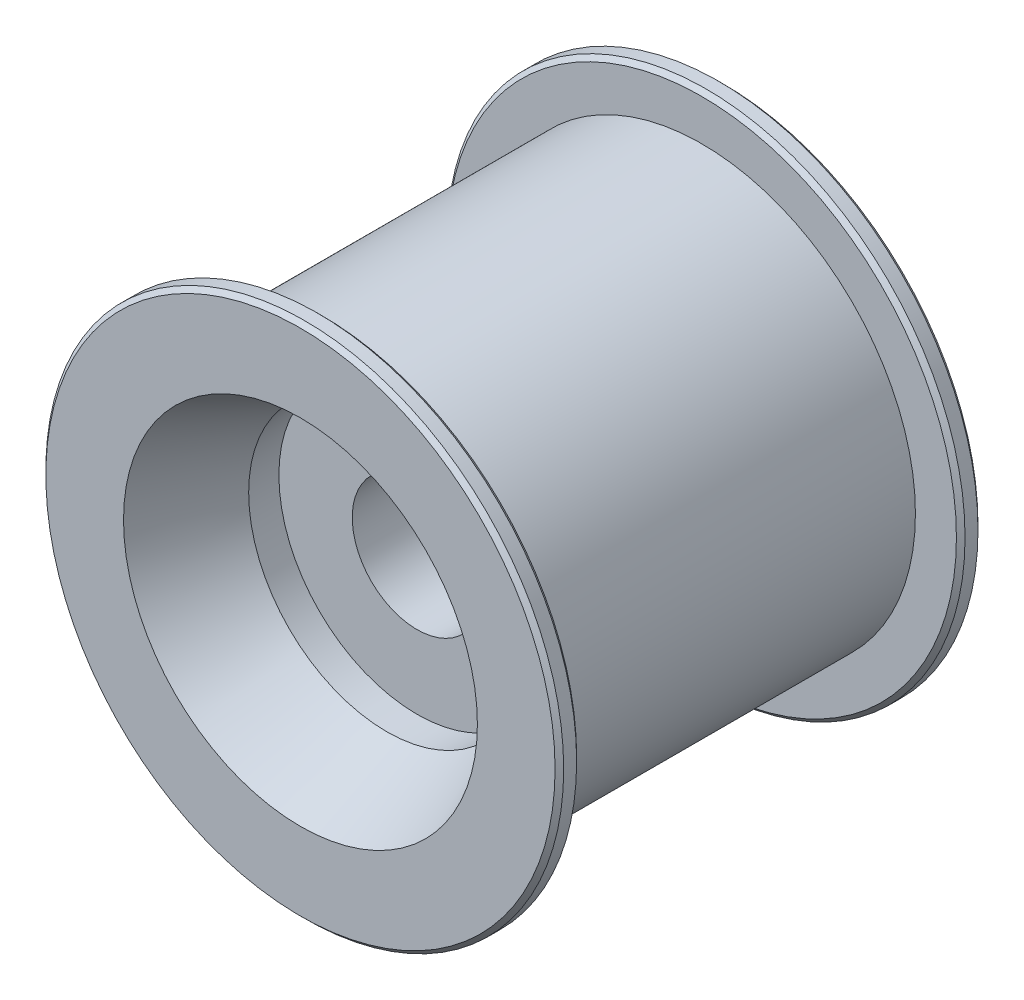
ISO-10303-21;
HEADER;
FILE_DESCRIPTION(('STEP AP214'),'2;1');
FILE_NAME('part.step','',(''),(''),'','','');
FILE_SCHEMA(('AUTOMOTIVE_DESIGN { 1 0 10303 214 1 1 1 1 }'));
ENDSEC;
DATA;
#1=APPLICATION_CONTEXT('core data for automotive mechanical design processes');
#2=APPLICATION_PROTOCOL_DEFINITION('international standard','automotive_design',2000,#1);
#3=PRODUCT_CONTEXT('',#1,'mechanical');
#4=PRODUCT('Part','Part','',(#3));
#5=PRODUCT_RELATED_PRODUCT_CATEGORY('part','',(#4));
#6=PRODUCT_DEFINITION_FORMATION('','',#4);
#7=PRODUCT_DEFINITION_CONTEXT('part definition',#1,'design');
#8=PRODUCT_DEFINITION('design','',#6,#7);
#9=PRODUCT_DEFINITION_SHAPE('','',#8);
#10=(LENGTH_UNIT() NAMED_UNIT(*) SI_UNIT(.MILLI.,.METRE.));
#11=(NAMED_UNIT(*) PLANE_ANGLE_UNIT() SI_UNIT($,.RADIAN.));
#12=(NAMED_UNIT(*) SI_UNIT($,.STERADIAN.) SOLID_ANGLE_UNIT());
#13=UNCERTAINTY_MEASURE_WITH_UNIT(LENGTH_MEASURE(1.E-05),#10,'distance_accuracy_value','');
#14=(GEOMETRIC_REPRESENTATION_CONTEXT(3) GLOBAL_UNCERTAINTY_ASSIGNED_CONTEXT((#13)) GLOBAL_UNIT_ASSIGNED_CONTEXT((#10,
#11,#12)) REPRESENTATION_CONTEXT('',''));
#15=CARTESIAN_POINT('',(0.,0.,0.));
#16=DIRECTION('',(0.,0.,1.));
#17=DIRECTION('',(1.,0.,0.));
#18=AXIS2_PLACEMENT_3D('',#15,#16,#17);
#19=CARTESIAN_POINT('',(0.,-7.5,-11.));
#20=DIRECTION('',(0.,0.,-1.));
#21=DIRECTION('',(1.,0.,0.));
#22=AXIS2_PLACEMENT_3D('',#19,#20,#21);
#23=PLANE('',#22);
#24=CARTESIAN_POINT('',(0.,0.,-11.));
#25=DIRECTION('',(0.,0.,-1.));
#26=DIRECTION('',(1.,0.,0.));
#27=AXIS2_PLACEMENT_3D('',#24,#25,#26);
#28=CIRCLE('',#27,16.);
#29=CARTESIAN_POINT('',(16.,0.,-11.));
#30=VERTEX_POINT('',#29);
#31=EDGE_CURVE('E71',#30,#30,#28,.T.);
#32=ORIENTED_EDGE('',*,*,#31,.T.);
#33=EDGE_LOOP('',(#32));
#34=FACE_BOUND('',#33,.T.);
#35=CARTESIAN_POINT('',(0.,0.,-11.));
#36=DIRECTION('',(0.,0.,-1.));
#37=DIRECTION('',(1.,0.,0.));
#38=AXIS2_PLACEMENT_3D('',#35,#36,#37);
#39=CIRCLE('',#38,7.5);
#40=CARTESIAN_POINT('',(7.5,0.,-11.));
#41=VERTEX_POINT('',#40);
#42=EDGE_CURVE('E44',#41,#41,#39,.T.);
#43=ORIENTED_EDGE('',*,*,#42,.F.);
#44=EDGE_LOOP('',(#43));
#45=FACE_BOUND('',#44,.T.);
#46=ADVANCED_FACE('F12',(#34,#45),#23,.T.);
#47=CARTESIAN_POINT('',(0.,0.,-20.));
#48=DIRECTION('',(0.,0.,-1.));
#49=DIRECTION('',(1.,0.,0.));
#50=AXIS2_PLACEMENT_3D('',#47,#48,#49);
#51=CYLINDRICAL_SURFACE('',#50,7.5);
#52=ORIENTED_EDGE('',*,*,#42,.T.);
#53=EDGE_LOOP('',(#52));
#54=FACE_BOUND('',#53,.T.);
#55=CARTESIAN_POINT('',(0.,0.,11.));
#56=DIRECTION('',(0.,0.,-1.));
#57=DIRECTION('',(1.,0.,0.));
#58=AXIS2_PLACEMENT_3D('',#55,#56,#57);
#59=CIRCLE('',#58,7.5);
#60=CARTESIAN_POINT('',(7.5,0.,11.));
#61=VERTEX_POINT('',#60);
#62=EDGE_CURVE('E47',#61,#61,#59,.T.);
#63=ORIENTED_EDGE('',*,*,#62,.F.);
#64=EDGE_LOOP('',(#63));
#65=FACE_BOUND('',#64,.T.);
#66=ADVANCED_FACE('F96',(#54,#65),#51,.F.);
#67=CARTESIAN_POINT('',(0.,-7.5,11.));
#68=DIRECTION('',(0.,0.,-1.));
#69=DIRECTION('',(1.,0.,0.));
#70=AXIS2_PLACEMENT_3D('',#67,#68,#69);
#71=PLANE('',#70);
#72=CARTESIAN_POINT('',(0.,0.,11.));
#73=DIRECTION('',(0.,0.,-1.));
#74=DIRECTION('',(1.,0.,0.));
#75=AXIS2_PLACEMENT_3D('',#72,#73,#74);
#76=CIRCLE('',#75,16.);
#77=CARTESIAN_POINT('',(16.,0.,11.));
#78=VERTEX_POINT('',#77);
#79=EDGE_CURVE('E50',#78,#78,#76,.T.);
#80=ORIENTED_EDGE('',*,*,#79,.F.);
#81=EDGE_LOOP('',(#80));
#82=FACE_BOUND('',#81,.T.);
#83=ORIENTED_EDGE('',*,*,#62,.T.);
#84=EDGE_LOOP('',(#83));
#85=FACE_BOUND('',#84,.T.);
#86=ADVANCED_FACE('F102',(#82,#85),#71,.F.);
#87=CARTESIAN_POINT('',(0.,0.,-20.));
#88=DIRECTION('',(0.,0.,-1.));
#89=DIRECTION('',(1.,0.,0.));
#90=AXIS2_PLACEMENT_3D('',#87,#88,#89);
#91=CYLINDRICAL_SURFACE('',#90,16.);
#92=CARTESIAN_POINT('',(0.,0.,14.5));
#93=DIRECTION('',(0.,0.,-1.));
#94=DIRECTION('',(1.,0.,0.));
#95=AXIS2_PLACEMENT_3D('',#92,#93,#94);
#96=CIRCLE('',#95,16.);
#97=CARTESIAN_POINT('',(16.,0.,14.5));
#98=VERTEX_POINT('',#97);
#99=EDGE_CURVE('E53',#98,#98,#96,.T.);
#100=ORIENTED_EDGE('',*,*,#99,.F.);
#101=EDGE_LOOP('',(#100));
#102=FACE_BOUND('',#101,.T.);
#103=ORIENTED_EDGE('',*,*,#79,.T.);
#104=EDGE_LOOP('',(#103));
#105=FACE_BOUND('',#104,.T.);
#106=ADVANCED_FACE('F141',(#102,#105),#91,.F.);
#107=CARTESIAN_POINT('',(0.,0.,14.5));
#108=DIRECTION('',(0.,0.,1.));
#109=DIRECTION('',(-1.,0.,0.));
#110=AXIS2_PLACEMENT_3D('',#107,#108,#109);
#111=CONICAL_SURFACE('',#110,16.,0.42285392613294);
#112=CARTESIAN_POINT('',(0.,0.,24.5));
#113=DIRECTION('',(0.,0.,-1.));
#114=DIRECTION('',(1.,0.,0.));
#115=AXIS2_PLACEMENT_3D('',#112,#113,#114);
#116=CIRCLE('',#115,20.5);
#117=CARTESIAN_POINT('',(20.5,0.,24.5));
#118=VERTEX_POINT('',#117);
#119=EDGE_CURVE('E56',#118,#118,#116,.T.);
#120=ORIENTED_EDGE('',*,*,#119,.F.);
#121=EDGE_LOOP('',(#120));
#122=FACE_BOUND('',#121,.T.);
#123=ORIENTED_EDGE('',*,*,#99,.T.);
#124=EDGE_LOOP('',(#123));
#125=FACE_BOUND('',#124,.T.);
#126=ADVANCED_FACE('F135',(#122,#125),#111,.F.);
#127=CARTESIAN_POINT('',(0.,-30.,24.5));
#128=DIRECTION('',(0.,0.,1.));
#129=DIRECTION('',(-1.,0.,0.));
#130=AXIS2_PLACEMENT_3D('',#127,#128,#129);
#131=PLANE('',#130);
#132=CARTESIAN_POINT('',(0.,0.,24.5));
#133=DIRECTION('',(0.,0.,1.));
#134=DIRECTION('',(1.,0.,0.));
#135=AXIS2_PLACEMENT_3D('',#132,#133,#134);
#136=CIRCLE('',#135,29.5);
#137=CARTESIAN_POINT('',(29.5,0.,24.5));
#138=VERTEX_POINT('',#137);
#139=EDGE_CURVE('E19',#138,#138,#136,.T.);
#140=ORIENTED_EDGE('',*,*,#139,.T.);
#141=EDGE_LOOP('',(#140));
#142=FACE_BOUND('',#141,.T.);
#143=ORIENTED_EDGE('',*,*,#119,.T.);
#144=EDGE_LOOP('',(#143));
#145=FACE_BOUND('',#144,.T.);
#146=ADVANCED_FACE('F124',(#142,#145),#131,.T.);
#147=CARTESIAN_POINT('',(0.,0.,-20.));
#148=DIRECTION('',(0.,0.,-1.));
#149=DIRECTION('',(1.,0.,0.));
#150=AXIS2_PLACEMENT_3D('',#147,#148,#149);
#151=CYLINDRICAL_SURFACE('',#150,30.);
#152=CARTESIAN_POINT('',(0.,0.,24.));
#153=DIRECTION('',(0.,0.,1.));
#154=DIRECTION('',(1.,0.,0.));
#155=AXIS2_PLACEMENT_3D('',#152,#153,#154);
#156=CIRCLE('',#155,30.);
#157=CARTESIAN_POINT('',(30.,0.,24.));
#158=VERTEX_POINT('',#157);
#159=EDGE_CURVE('E23',#158,#158,#156,.F.);
#160=ORIENTED_EDGE('',*,*,#159,.T.);
#161=EDGE_LOOP('',(#160));
#162=FACE_BOUND('',#161,.T.);
#163=CARTESIAN_POINT('',(0.,0.,22.5));
#164=DIRECTION('',(0.,0.,1.));
#165=DIRECTION('',(1.,0.,0.));
#166=AXIS2_PLACEMENT_3D('',#163,#164,#165);
#167=CIRCLE('',#166,30.);
#168=CARTESIAN_POINT('',(30.,0.,22.5));
#169=VERTEX_POINT('',#168);
#170=EDGE_CURVE('E27',#169,#169,#167,.T.);
#171=ORIENTED_EDGE('',*,*,#170,.T.);
#172=EDGE_LOOP('',(#171));
#173=FACE_BOUND('',#172,.T.);
#174=ADVANCED_FACE('F120',(#162,#173),#151,.T.);
#175=CARTESIAN_POINT('',(0.,-30.,22.));
#176=DIRECTION('',(0.,0.,1.));
#177=DIRECTION('',(-1.,0.,0.));
#178=AXIS2_PLACEMENT_3D('',#175,#176,#177);
#179=PLANE('',#178);
#180=CARTESIAN_POINT('',(0.,0.,22.));
#181=DIRECTION('',(0.,0.,1.));
#182=DIRECTION('',(1.,0.,0.));
#183=AXIS2_PLACEMENT_3D('',#180,#181,#182);
#184=CIRCLE('',#183,29.5);
#185=CARTESIAN_POINT('',(29.5,0.,22.));
#186=VERTEX_POINT('',#185);
#187=EDGE_CURVE('E8',#186,#186,#184,.F.);
#188=ORIENTED_EDGE('',*,*,#187,.T.);
#189=EDGE_LOOP('',(#188));
#190=FACE_BOUND('',#189,.T.);
#191=CARTESIAN_POINT('',(0.,0.,22.));
#192=DIRECTION('',(0.,0.,-1.));
#193=DIRECTION('',(1.,0.,0.));
#194=AXIS2_PLACEMENT_3D('',#191,#192,#193);
#195=CIRCLE('',#194,24.75);
#196=CARTESIAN_POINT('',(24.75,0.,22.));
#197=VERTEX_POINT('',#196);
#198=EDGE_CURVE('E59',#197,#197,#195,.T.);
#199=ORIENTED_EDGE('',*,*,#198,.F.);
#200=EDGE_LOOP('',(#199));
#201=FACE_BOUND('',#200,.T.);
#202=ADVANCED_FACE('F123',(#190,#201),#179,.F.);
#203=CARTESIAN_POINT('',(0.,0.,-20.));
#204=DIRECTION('',(0.,0.,-1.));
#205=DIRECTION('',(1.,0.,0.));
#206=AXIS2_PLACEMENT_3D('',#203,#204,#205);
#207=CYLINDRICAL_SURFACE('',#206,24.75);
#208=ORIENTED_EDGE('',*,*,#198,.T.);
#209=EDGE_LOOP('',(#208));
#210=FACE_BOUND('',#209,.T.);
#211=CARTESIAN_POINT('',(0.,0.,-22.));
#212=DIRECTION('',(0.,0.,-1.));
#213=DIRECTION('',(1.,0.,0.));
#214=AXIS2_PLACEMENT_3D('',#211,#212,#213);
#215=CIRCLE('',#214,24.75);
#216=CARTESIAN_POINT('',(24.75,0.,-22.));
#217=VERTEX_POINT('',#216);
#218=EDGE_CURVE('E62',#217,#217,#215,.T.);
#219=ORIENTED_EDGE('',*,*,#218,.F.);
#220=EDGE_LOOP('',(#219));
#221=FACE_BOUND('',#220,.T.);
#222=ADVANCED_FACE('F133',(#210,#221),#207,.T.);
#223=CARTESIAN_POINT('',(0.,-30.,-22.));
#224=DIRECTION('',(0.,0.,1.));
#225=DIRECTION('',(-1.,0.,0.));
#226=AXIS2_PLACEMENT_3D('',#223,#224,#225);
#227=PLANE('',#226);
#228=CARTESIAN_POINT('',(0.,0.,-22.));
#229=DIRECTION('',(0.,0.,1.));
#230=DIRECTION('',(1.,0.,0.));
#231=AXIS2_PLACEMENT_3D('',#228,#229,#230);
#232=CIRCLE('',#231,29.5);
#233=CARTESIAN_POINT('',(29.5,0.,-22.));
#234=VERTEX_POINT('',#233);
#235=EDGE_CURVE('E32',#234,#234,#232,.T.);
#236=ORIENTED_EDGE('',*,*,#235,.T.);
#237=EDGE_LOOP('',(#236));
#238=FACE_BOUND('',#237,.T.);
#239=ORIENTED_EDGE('',*,*,#218,.T.);
#240=EDGE_LOOP('',(#239));
#241=FACE_BOUND('',#240,.T.);
#242=ADVANCED_FACE('F245',(#238,#241),#227,.T.);
#243=CARTESIAN_POINT('',(0.,0.,-20.));
#244=DIRECTION('',(0.,0.,-1.));
#245=DIRECTION('',(1.,0.,0.));
#246=AXIS2_PLACEMENT_3D('',#243,#244,#245);
#247=CYLINDRICAL_SURFACE('',#246,30.);
#248=CARTESIAN_POINT('',(0.,0.,-24.));
#249=DIRECTION('',(0.,0.,1.));
#250=DIRECTION('',(1.,0.,0.));
#251=AXIS2_PLACEMENT_3D('',#248,#249,#250);
#252=CIRCLE('',#251,30.);
#253=CARTESIAN_POINT('',(30.,0.,-24.));
#254=VERTEX_POINT('',#253);
#255=EDGE_CURVE('E35',#254,#254,#252,.T.);
#256=ORIENTED_EDGE('',*,*,#255,.T.);
#257=EDGE_LOOP('',(#256));
#258=FACE_BOUND('',#257,.T.);
#259=CARTESIAN_POINT('',(0.,0.,-22.5));
#260=DIRECTION('',(0.,0.,1.));
#261=DIRECTION('',(1.,0.,0.));
#262=AXIS2_PLACEMENT_3D('',#259,#260,#261);
#263=CIRCLE('',#262,30.);
#264=CARTESIAN_POINT('',(30.,0.,-22.5));
#265=VERTEX_POINT('',#264);
#266=EDGE_CURVE('E38',#265,#265,#263,.F.);
#267=ORIENTED_EDGE('',*,*,#266,.T.);
#268=EDGE_LOOP('',(#267));
#269=FACE_BOUND('',#268,.T.);
#270=ADVANCED_FACE('F237',(#258,#269),#247,.T.);
#271=CARTESIAN_POINT('',(0.,-30.,-24.5));
#272=DIRECTION('',(0.,0.,1.));
#273=DIRECTION('',(-1.,0.,0.));
#274=AXIS2_PLACEMENT_3D('',#271,#272,#273);
#275=PLANE('',#274);
#276=CARTESIAN_POINT('',(0.,0.,-24.5));
#277=DIRECTION('',(0.,0.,1.));
#278=DIRECTION('',(1.,0.,0.));
#279=AXIS2_PLACEMENT_3D('',#276,#277,#278);
#280=CIRCLE('',#279,29.5);
#281=CARTESIAN_POINT('',(29.5,0.,-24.5));
#282=VERTEX_POINT('',#281);
#283=EDGE_CURVE('E41',#282,#282,#280,.F.);
#284=ORIENTED_EDGE('',*,*,#283,.T.);
#285=EDGE_LOOP('',(#284));
#286=FACE_BOUND('',#285,.T.);
#287=CARTESIAN_POINT('',(0.,0.,-24.5));
#288=DIRECTION('',(0.,0.,-1.));
#289=DIRECTION('',(1.,0.,0.));
#290=AXIS2_PLACEMENT_3D('',#287,#288,#289);
#291=CIRCLE('',#290,20.5);
#292=CARTESIAN_POINT('',(20.5,0.,-24.5));
#293=VERTEX_POINT('',#292);
#294=EDGE_CURVE('E65',#293,#293,#291,.T.);
#295=ORIENTED_EDGE('',*,*,#294,.F.);
#296=EDGE_LOOP('',(#295));
#297=FACE_BOUND('',#296,.T.);
#298=ADVANCED_FACE('F92',(#286,#297),#275,.F.);
#299=CARTESIAN_POINT('',(0.,0.,-14.5));
#300=DIRECTION('',(0.,0.,-1.));
#301=DIRECTION('',(1.,0.,0.));
#302=AXIS2_PLACEMENT_3D('',#299,#300,#301);
#303=CONICAL_SURFACE('',#302,16.,0.42285392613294);
#304=ORIENTED_EDGE('',*,*,#294,.T.);
#305=EDGE_LOOP('',(#304));
#306=FACE_BOUND('',#305,.T.);
#307=CARTESIAN_POINT('',(0.,0.,-14.5));
#308=DIRECTION('',(0.,0.,-1.));
#309=DIRECTION('',(1.,0.,0.));
#310=AXIS2_PLACEMENT_3D('',#307,#308,#309);
#311=CIRCLE('',#310,16.);
#312=CARTESIAN_POINT('',(16.,0.,-14.5));
#313=VERTEX_POINT('',#312);
#314=EDGE_CURVE('E68',#313,#313,#311,.T.);
#315=ORIENTED_EDGE('',*,*,#314,.F.);
#316=EDGE_LOOP('',(#315));
#317=FACE_BOUND('',#316,.T.);
#318=ADVANCED_FACE('F80',(#306,#317),#303,.F.);
#319=CARTESIAN_POINT('',(0.,0.,-20.));
#320=DIRECTION('',(0.,0.,-1.));
#321=DIRECTION('',(1.,0.,0.));
#322=AXIS2_PLACEMENT_3D('',#319,#320,#321);
#323=CYLINDRICAL_SURFACE('',#322,16.);
#324=ORIENTED_EDGE('',*,*,#314,.T.);
#325=EDGE_LOOP('',(#324));
#326=FACE_BOUND('',#325,.T.);
#327=ORIENTED_EDGE('',*,*,#31,.F.);
#328=EDGE_LOOP('',(#327));
#329=FACE_BOUND('',#328,.T.);
#330=ADVANCED_FACE('F77',(#326,#329),#323,.F.);
#331=CARTESIAN_POINT('',(0.,0.,-24.5));
#332=DIRECTION('',(0.,0.,1.));
#333=DIRECTION('',(1.,0.,0.));
#334=AXIS2_PLACEMENT_3D('',#331,#332,#333);
#335=CONICAL_SURFACE('',#334,29.5,0.785398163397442);
#336=ORIENTED_EDGE('',*,*,#255,.F.);
#337=EDGE_LOOP('',(#336));
#338=FACE_BOUND('',#337,.T.);
#339=ORIENTED_EDGE('',*,*,#283,.F.);
#340=EDGE_LOOP('',(#339));
#341=FACE_BOUND('',#340,.T.);
#342=ADVANCED_FACE('F79',(#338,#341),#335,.T.);
#343=CARTESIAN_POINT('',(0.,0.,-22.5));
#344=DIRECTION('',(0.,0.,-1.));
#345=DIRECTION('',(-1.,0.,0.));
#346=AXIS2_PLACEMENT_3D('',#343,#344,#345);
#347=CONICAL_SURFACE('',#346,30.,0.785398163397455);
#348=ORIENTED_EDGE('',*,*,#235,.F.);
#349=EDGE_LOOP('',(#348));
#350=FACE_BOUND('',#349,.T.);
#351=ORIENTED_EDGE('',*,*,#266,.F.);
#352=EDGE_LOOP('',(#351));
#353=FACE_BOUND('',#352,.T.);
#354=ADVANCED_FACE('F89',(#350,#353),#347,.T.);
#355=CARTESIAN_POINT('',(0.,0.,24.));
#356=DIRECTION('',(0.,0.,-1.));
#357=DIRECTION('',(-1.,0.,0.));
#358=AXIS2_PLACEMENT_3D('',#355,#356,#357);
#359=CONICAL_SURFACE('',#358,30.,0.785398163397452);
#360=ORIENTED_EDGE('',*,*,#139,.F.);
#361=EDGE_LOOP('',(#360));
#362=FACE_BOUND('',#361,.T.);
#363=ORIENTED_EDGE('',*,*,#159,.F.);
#364=EDGE_LOOP('',(#363));
#365=FACE_BOUND('',#364,.T.);
#366=ADVANCED_FACE('F108',(#362,#365),#359,.T.);
#367=CARTESIAN_POINT('',(0.,0.,22.));
#368=DIRECTION('',(0.,0.,1.));
#369=DIRECTION('',(1.,0.,0.));
#370=AXIS2_PLACEMENT_3D('',#367,#368,#369);
#371=CONICAL_SURFACE('',#370,29.5,0.785398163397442);
#372=ORIENTED_EDGE('',*,*,#170,.F.);
#373=EDGE_LOOP('',(#372));
#374=FACE_BOUND('',#373,.T.);
#375=ORIENTED_EDGE('',*,*,#187,.F.);
#376=EDGE_LOOP('',(#375));
#377=FACE_BOUND('',#376,.T.);
#378=ADVANCED_FACE('F14',(#374,#377),#371,.T.);
#379=CLOSED_SHELL('',(#46,#66,#86,#106,#126,#146,#174,#202,#222,#242,#270,#298,#318,#330,#342,
#354,#366,#378));
#380=MANIFOLD_SOLID_BREP('B1',#379);
#381=ADVANCED_BREP_SHAPE_REPRESENTATION('',(#18,#380),#14);
#382=SHAPE_DEFINITION_REPRESENTATION(#9,#381);
ENDSEC;
END-ISO-10303-21;
